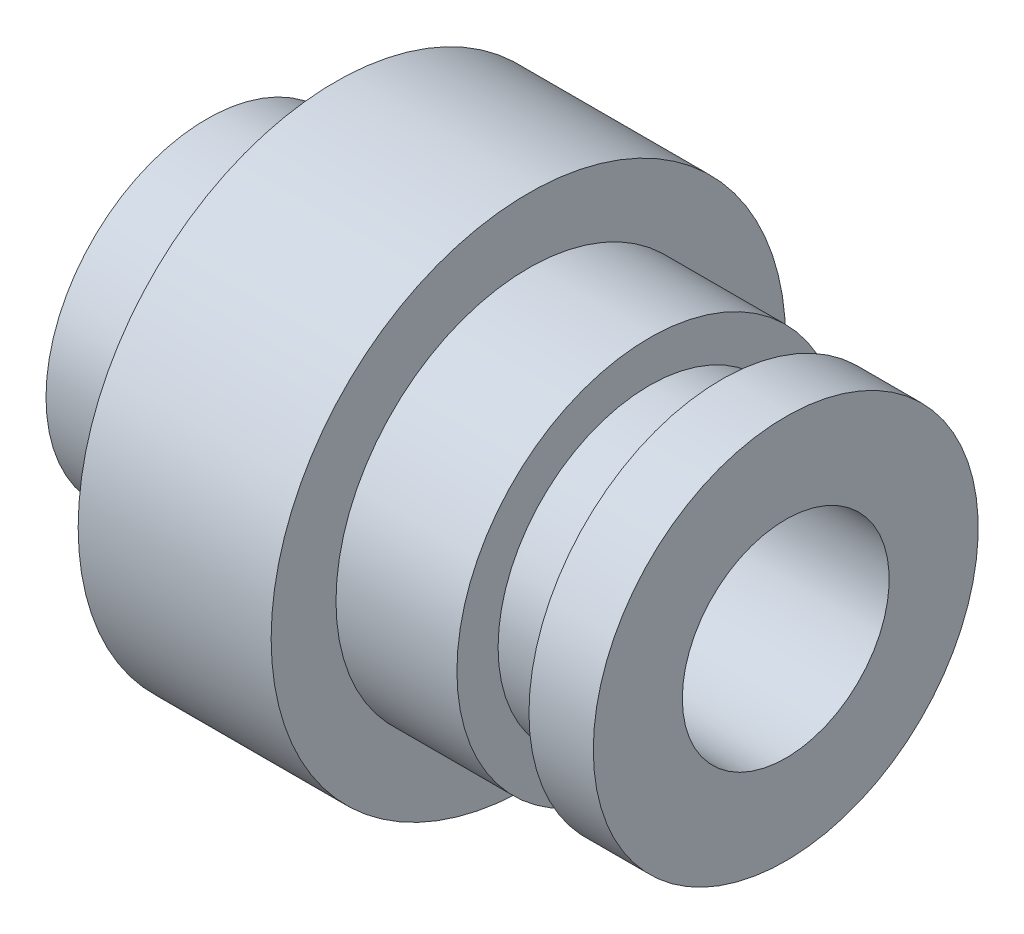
ISO-10303-21;
HEADER;
FILE_DESCRIPTION(('STEP AP214'),'2;1');
FILE_NAME('part.step','',(''),(''),'','','');
FILE_SCHEMA(('AUTOMOTIVE_DESIGN { 1 0 10303 214 1 1 1 1 }'));
ENDSEC;
DATA;
#1=APPLICATION_CONTEXT('core data for automotive mechanical design processes');
#2=APPLICATION_PROTOCOL_DEFINITION('international standard','automotive_design',2000,#1);
#3=PRODUCT_CONTEXT('',#1,'mechanical');
#4=PRODUCT('Part','Part','',(#3));
#5=PRODUCT_RELATED_PRODUCT_CATEGORY('part','',(#4));
#6=PRODUCT_DEFINITION_FORMATION('','',#4);
#7=PRODUCT_DEFINITION_CONTEXT('part definition',#1,'design');
#8=PRODUCT_DEFINITION('design','',#6,#7);
#9=PRODUCT_DEFINITION_SHAPE('','',#8);
#10=(LENGTH_UNIT() NAMED_UNIT(*) SI_UNIT(.MILLI.,.METRE.));
#11=(NAMED_UNIT(*) PLANE_ANGLE_UNIT() SI_UNIT($,.RADIAN.));
#12=(NAMED_UNIT(*) SI_UNIT($,.STERADIAN.) SOLID_ANGLE_UNIT());
#13=UNCERTAINTY_MEASURE_WITH_UNIT(LENGTH_MEASURE(1.E-05),#10,'distance_accuracy_value','');
#14=(GEOMETRIC_REPRESENTATION_CONTEXT(3) GLOBAL_UNCERTAINTY_ASSIGNED_CONTEXT((#13)) GLOBAL_UNIT_ASSIGNED_CONTEXT((#10,
#11,#12)) REPRESENTATION_CONTEXT('',''));
#15=CARTESIAN_POINT('',(0.,0.,0.));
#16=DIRECTION('',(0.,0.,1.));
#17=DIRECTION('',(1.,0.,0.));
#18=AXIS2_PLACEMENT_3D('',#15,#16,#17);
#19=CARTESIAN_POINT('',(0.,6.35,0.));
#20=DIRECTION('',(1.,0.,0.));
#21=DIRECTION('',(0.,0.,-1.));
#22=AXIS2_PLACEMENT_3D('',#19,#20,#21);
#23=PLANE('',#22);
#24=CARTESIAN_POINT('',(0.,0.,0.));
#25=DIRECTION('',(-1.,0.,0.));
#26=DIRECTION('',(0.,0.,1.));
#27=AXIS2_PLACEMENT_3D('',#24,#25,#26);
#28=CIRCLE('',#27,5.1054);
#29=CARTESIAN_POINT('',(0.,0.,5.1054));
#30=VERTEX_POINT('',#29);
#31=EDGE_CURVE('E40',#30,#30,#28,.T.);
#32=ORIENTED_EDGE('',*,*,#31,.F.);
#33=EDGE_LOOP('',(#32));
#34=FACE_BOUND('',#33,.T.);
#35=CARTESIAN_POINT('',(0.,0.,0.));
#36=DIRECTION('',(-1.,0.,0.));
#37=DIRECTION('',(0.,0.,1.));
#38=AXIS2_PLACEMENT_3D('',#35,#36,#37);
#39=CIRCLE('',#38,6.35);
#40=CARTESIAN_POINT('',(0.,0.,6.35));
#41=VERTEX_POINT('',#40);
#42=EDGE_CURVE('E79',#41,#41,#39,.T.);
#43=ORIENTED_EDGE('',*,*,#42,.T.);
#44=EDGE_LOOP('',(#43));
#45=FACE_BOUND('',#44,.T.);
#46=ADVANCED_FACE('F29',(#34,#45),#23,.F.);
#47=CARTESIAN_POINT('',(0.,0.,0.));
#48=DIRECTION('',(-1.,0.,0.));
#49=DIRECTION('',(0.,0.,1.));
#50=AXIS2_PLACEMENT_3D('',#47,#48,#49);
#51=CYLINDRICAL_SURFACE('',#50,5.1054);
#52=CARTESIAN_POINT('',(15.875,0.,0.));
#53=DIRECTION('',(-1.,0.,0.));
#54=DIRECTION('',(0.,0.,1.));
#55=AXIS2_PLACEMENT_3D('',#52,#53,#54);
#56=CIRCLE('',#55,5.1054);
#57=CARTESIAN_POINT('',(15.875,0.,5.1054));
#58=VERTEX_POINT('',#57);
#59=EDGE_CURVE('E44',#58,#58,#56,.T.);
#60=ORIENTED_EDGE('',*,*,#59,.F.);
#61=EDGE_LOOP('',(#60));
#62=FACE_BOUND('',#61,.T.);
#63=ORIENTED_EDGE('',*,*,#31,.T.);
#64=EDGE_LOOP('',(#63));
#65=FACE_BOUND('',#64,.T.);
#66=ADVANCED_FACE('F106',(#62,#65),#51,.F.);
#67=CARTESIAN_POINT('',(15.875,5.1054,0.));
#68=DIRECTION('',(-1.,0.,0.));
#69=DIRECTION('',(0.,0.,1.));
#70=AXIS2_PLACEMENT_3D('',#67,#68,#69);
#71=PLANE('',#70);
#72=CARTESIAN_POINT('',(15.875,0.,0.));
#73=DIRECTION('',(-1.,0.,0.));
#74=DIRECTION('',(0.,0.,1.));
#75=AXIS2_PLACEMENT_3D('',#72,#73,#74);
#76=CIRCLE('',#75,9.4996);
#77=CARTESIAN_POINT('',(15.875,0.,9.4996));
#78=VERTEX_POINT('',#77);
#79=EDGE_CURVE('E49',#78,#78,#76,.T.);
#80=ORIENTED_EDGE('',*,*,#79,.F.);
#81=EDGE_LOOP('',(#80));
#82=FACE_BOUND('',#81,.T.);
#83=ORIENTED_EDGE('',*,*,#59,.T.);
#84=EDGE_LOOP('',(#83));
#85=FACE_BOUND('',#84,.T.);
#86=ADVANCED_FACE('F111',(#82,#85),#71,.F.);
#87=CARTESIAN_POINT('',(0.,0.,0.));
#88=DIRECTION('',(-1.,0.,0.));
#89=DIRECTION('',(0.,0.,1.));
#90=AXIS2_PLACEMENT_3D('',#87,#88,#89);
#91=CYLINDRICAL_SURFACE('',#90,9.4996);
#92=CARTESIAN_POINT('',(12.7,0.,0.));
#93=DIRECTION('',(-1.,0.,0.));
#94=DIRECTION('',(0.,0.,1.));
#95=AXIS2_PLACEMENT_3D('',#92,#93,#94);
#96=CIRCLE('',#95,9.4996);
#97=CARTESIAN_POINT('',(12.7,0.,9.4996));
#98=VERTEX_POINT('',#97);
#99=EDGE_CURVE('E52',#98,#98,#96,.T.);
#100=ORIENTED_EDGE('',*,*,#99,.F.);
#101=EDGE_LOOP('',(#100));
#102=FACE_BOUND('',#101,.T.);
#103=ORIENTED_EDGE('',*,*,#79,.T.);
#104=EDGE_LOOP('',(#103));
#105=FACE_BOUND('',#104,.T.);
#106=ADVANCED_FACE('F118',(#102,#105),#91,.T.);
#107=CARTESIAN_POINT('',(12.7,9.4996,0.));
#108=DIRECTION('',(1.,0.,0.));
#109=DIRECTION('',(0.,0.,-1.));
#110=AXIS2_PLACEMENT_3D('',#107,#108,#109);
#111=PLANE('',#110);
#112=CARTESIAN_POINT('',(12.7,0.,0.));
#113=DIRECTION('',(-1.,0.,0.));
#114=DIRECTION('',(0.,0.,1.));
#115=AXIS2_PLACEMENT_3D('',#112,#113,#114);
#116=CIRCLE('',#115,7.4676);
#117=CARTESIAN_POINT('',(12.7,0.,7.4676));
#118=VERTEX_POINT('',#117);
#119=EDGE_CURVE('E55',#118,#118,#116,.T.);
#120=ORIENTED_EDGE('',*,*,#119,.F.);
#121=EDGE_LOOP('',(#120));
#122=FACE_BOUND('',#121,.T.);
#123=ORIENTED_EDGE('',*,*,#99,.T.);
#124=EDGE_LOOP('',(#123));
#125=FACE_BOUND('',#124,.T.);
#126=ADVANCED_FACE('F122',(#122,#125),#111,.F.);
#127=CARTESIAN_POINT('',(0.,0.,0.));
#128=DIRECTION('',(-1.,0.,0.));
#129=DIRECTION('',(0.,0.,1.));
#130=AXIS2_PLACEMENT_3D('',#127,#128,#129);
#131=CYLINDRICAL_SURFACE('',#130,7.4676);
#132=CARTESIAN_POINT('',(9.144,0.,0.));
#133=DIRECTION('',(-1.,0.,0.));
#134=DIRECTION('',(0.,0.,1.));
#135=AXIS2_PLACEMENT_3D('',#132,#133,#134);
#136=CIRCLE('',#135,7.4676);
#137=CARTESIAN_POINT('',(9.144,0.,7.4676));
#138=VERTEX_POINT('',#137);
#139=EDGE_CURVE('E58',#138,#138,#136,.T.);
#140=ORIENTED_EDGE('',*,*,#139,.F.);
#141=EDGE_LOOP('',(#140));
#142=FACE_BOUND('',#141,.T.);
#143=ORIENTED_EDGE('',*,*,#119,.T.);
#144=EDGE_LOOP('',(#143));
#145=FACE_BOUND('',#144,.T.);
#146=ADVANCED_FACE('F126',(#142,#145),#131,.T.);
#147=CARTESIAN_POINT('',(9.144,7.4676,0.));
#148=DIRECTION('',(-1.,0.,0.));
#149=DIRECTION('',(0.,0.,1.));
#150=AXIS2_PLACEMENT_3D('',#147,#148,#149);
#151=PLANE('',#150);
#152=CARTESIAN_POINT('',(9.144,0.,0.));
#153=DIRECTION('',(-1.,0.,0.));
#154=DIRECTION('',(0.,0.,1.));
#155=AXIS2_PLACEMENT_3D('',#152,#153,#154);
#156=CIRCLE('',#155,9.4996);
#157=CARTESIAN_POINT('',(9.144,0.,9.4996));
#158=VERTEX_POINT('',#157);
#159=EDGE_CURVE('E61',#158,#158,#156,.T.);
#160=ORIENTED_EDGE('',*,*,#159,.F.);
#161=EDGE_LOOP('',(#160));
#162=FACE_BOUND('',#161,.T.);
#163=ORIENTED_EDGE('',*,*,#139,.T.);
#164=EDGE_LOOP('',(#163));
#165=FACE_BOUND('',#164,.T.);
#166=ADVANCED_FACE('F130',(#162,#165),#151,.F.);
#167=CARTESIAN_POINT('',(0.,0.,0.));
#168=DIRECTION('',(-1.,0.,0.));
#169=DIRECTION('',(0.,0.,1.));
#170=AXIS2_PLACEMENT_3D('',#167,#168,#169);
#171=CYLINDRICAL_SURFACE('',#170,9.4996);
#172=CARTESIAN_POINT('',(3.175,0.,0.));
#173=DIRECTION('',(-1.,0.,0.));
#174=DIRECTION('',(0.,0.,1.));
#175=AXIS2_PLACEMENT_3D('',#172,#173,#174);
#176=CIRCLE('',#175,9.4996);
#177=CARTESIAN_POINT('',(3.175,0.,9.4996));
#178=VERTEX_POINT('',#177);
#179=EDGE_CURVE('E64',#178,#178,#176,.T.);
#180=ORIENTED_EDGE('',*,*,#179,.F.);
#181=EDGE_LOOP('',(#180));
#182=FACE_BOUND('',#181,.T.);
#183=ORIENTED_EDGE('',*,*,#159,.T.);
#184=EDGE_LOOP('',(#183));
#185=FACE_BOUND('',#184,.T.);
#186=ADVANCED_FACE('F134',(#182,#185),#171,.T.);
#187=CARTESIAN_POINT('',(3.175,9.4996,0.));
#188=DIRECTION('',(-1.,0.,0.));
#189=DIRECTION('',(0.,0.,1.));
#190=AXIS2_PLACEMENT_3D('',#187,#188,#189);
#191=PLANE('',#190);
#192=CARTESIAN_POINT('',(3.175,0.,0.));
#193=DIRECTION('',(-1.,0.,0.));
#194=DIRECTION('',(0.,0.,1.));
#195=AXIS2_PLACEMENT_3D('',#192,#193,#194);
#196=CIRCLE('',#195,12.7);
#197=CARTESIAN_POINT('',(3.175,0.,12.7));
#198=VERTEX_POINT('',#197);
#199=EDGE_CURVE('E67',#198,#198,#196,.T.);
#200=ORIENTED_EDGE('',*,*,#199,.F.);
#201=EDGE_LOOP('',(#200));
#202=FACE_BOUND('',#201,.T.);
#203=ORIENTED_EDGE('',*,*,#179,.T.);
#204=EDGE_LOOP('',(#203));
#205=FACE_BOUND('',#204,.T.);
#206=ADVANCED_FACE('F138',(#202,#205),#191,.F.);
#207=CARTESIAN_POINT('',(0.,0.,0.));
#208=DIRECTION('',(-1.,0.,0.));
#209=DIRECTION('',(0.,0.,1.));
#210=AXIS2_PLACEMENT_3D('',#207,#208,#209);
#211=CYLINDRICAL_SURFACE('',#210,12.7);
#212=CARTESIAN_POINT('',(-6.35,0.,0.));
#213=DIRECTION('',(-1.,0.,0.));
#214=DIRECTION('',(0.,0.,1.));
#215=AXIS2_PLACEMENT_3D('',#212,#213,#214);
#216=CIRCLE('',#215,12.7);
#217=CARTESIAN_POINT('',(-6.35,0.,12.7));
#218=VERTEX_POINT('',#217);
#219=EDGE_CURVE('E70',#218,#218,#216,.T.);
#220=ORIENTED_EDGE('',*,*,#219,.F.);
#221=EDGE_LOOP('',(#220));
#222=FACE_BOUND('',#221,.T.);
#223=ORIENTED_EDGE('',*,*,#199,.T.);
#224=EDGE_LOOP('',(#223));
#225=FACE_BOUND('',#224,.T.);
#226=ADVANCED_FACE('F103',(#222,#225),#211,.T.);
#227=CARTESIAN_POINT('',(-6.35,7.9375,0.));
#228=DIRECTION('',(1.,0.,0.));
#229=DIRECTION('',(0.,0.,-1.));
#230=AXIS2_PLACEMENT_3D('',#227,#228,#229);
#231=PLANE('',#230);
#232=CARTESIAN_POINT('',(-6.35,0.,0.));
#233=DIRECTION('',(1.,0.,0.));
#234=DIRECTION('',(0.,0.,-1.));
#235=AXIS2_PLACEMENT_3D('',#232,#233,#234);
#236=CIRCLE('',#235,11.1125);
#237=CARTESIAN_POINT('',(-6.35,0.,-11.1125));
#238=VERTEX_POINT('',#237);
#239=EDGE_CURVE('E10',#238,#238,#236,.T.);
#240=ORIENTED_EDGE('',*,*,#239,.T.);
#241=EDGE_LOOP('',(#240));
#242=FACE_BOUND('',#241,.T.);
#243=ORIENTED_EDGE('',*,*,#219,.T.);
#244=EDGE_LOOP('',(#243));
#245=FACE_BOUND('',#244,.T.);
#246=ADVANCED_FACE('F98',(#242,#245),#231,.F.);
#247=CARTESIAN_POINT('',(0.,0.,0.));
#248=DIRECTION('',(-1.,0.,0.));
#249=DIRECTION('',(0.,0.,1.));
#250=AXIS2_PLACEMENT_3D('',#247,#248,#249);
#251=CYLINDRICAL_SURFACE('',#250,7.9375);
#252=CARTESIAN_POINT('',(-9.525,0.,0.));
#253=DIRECTION('',(1.,0.,0.));
#254=DIRECTION('',(0.,0.,-1.));
#255=AXIS2_PLACEMENT_3D('',#252,#253,#254);
#256=CIRCLE('',#255,7.9375);
#257=CARTESIAN_POINT('',(-9.525,0.,-7.9375));
#258=VERTEX_POINT('',#257);
#259=EDGE_CURVE('E36',#258,#258,#256,.F.);
#260=ORIENTED_EDGE('',*,*,#259,.T.);
#261=EDGE_LOOP('',(#260));
#262=FACE_BOUND('',#261,.T.);
#263=CARTESIAN_POINT('',(-12.7,0.,0.));
#264=DIRECTION('',(-1.,0.,0.));
#265=DIRECTION('',(0.,0.,1.));
#266=AXIS2_PLACEMENT_3D('',#263,#264,#265);
#267=CIRCLE('',#266,7.9375);
#268=CARTESIAN_POINT('',(-12.7,0.,7.9375));
#269=VERTEX_POINT('',#268);
#270=EDGE_CURVE('E73',#269,#269,#267,.T.);
#271=ORIENTED_EDGE('',*,*,#270,.F.);
#272=EDGE_LOOP('',(#271));
#273=FACE_BOUND('',#272,.T.);
#274=ADVANCED_FACE('F93',(#262,#273),#251,.T.);
#275=CARTESIAN_POINT('',(-12.7,7.9375,0.));
#276=DIRECTION('',(1.,0.,0.));
#277=DIRECTION('',(0.,0.,-1.));
#278=AXIS2_PLACEMENT_3D('',#275,#276,#277);
#279=PLANE('',#278);
#280=CARTESIAN_POINT('',(-12.7,0.,0.));
#281=DIRECTION('',(-1.,0.,0.));
#282=DIRECTION('',(0.,0.,1.));
#283=AXIS2_PLACEMENT_3D('',#280,#281,#282);
#284=CIRCLE('',#283,6.35);
#285=CARTESIAN_POINT('',(-12.7,0.,6.35));
#286=VERTEX_POINT('',#285);
#287=EDGE_CURVE('E76',#286,#286,#284,.T.);
#288=ORIENTED_EDGE('',*,*,#287,.F.);
#289=EDGE_LOOP('',(#288));
#290=FACE_BOUND('',#289,.T.);
#291=ORIENTED_EDGE('',*,*,#270,.T.);
#292=EDGE_LOOP('',(#291));
#293=FACE_BOUND('',#292,.T.);
#294=ADVANCED_FACE('F87',(#290,#293),#279,.F.);
#295=CARTESIAN_POINT('',(0.,0.,0.));
#296=DIRECTION('',(-1.,0.,0.));
#297=DIRECTION('',(0.,0.,1.));
#298=AXIS2_PLACEMENT_3D('',#295,#296,#297);
#299=CYLINDRICAL_SURFACE('',#298,6.35);
#300=ORIENTED_EDGE('',*,*,#42,.F.);
#301=EDGE_LOOP('',(#300));
#302=FACE_BOUND('',#301,.T.);
#303=ORIENTED_EDGE('',*,*,#287,.T.);
#304=EDGE_LOOP('',(#303));
#305=FACE_BOUND('',#304,.T.);
#306=ADVANCED_FACE('F84',(#302,#305),#299,.F.);
#307=CARTESIAN_POINT('',(-9.525,0.,0.));
#308=DIRECTION('',(1.,0.,0.));
#309=DIRECTION('',(0.,0.,-1.));
#310=AXIS2_PLACEMENT_3D('',#307,#308,#309);
#311=TOROIDAL_SURFACE('',#310,11.1125,3.175);
#312=ORIENTED_EDGE('',*,*,#239,.F.);
#313=EDGE_LOOP('',(#312));
#314=FACE_BOUND('',#313,.T.);
#315=ORIENTED_EDGE('',*,*,#259,.F.);
#316=EDGE_LOOP('',(#315));
#317=FACE_BOUND('',#316,.T.);
#318=ADVANCED_FACE('F31',(#314,#317),#311,.F.);
#319=CLOSED_SHELL('',(#46,#66,#86,#106,#126,#146,#166,#186,#206,#226,#246,#274,#294,#306,#318));
#320=MANIFOLD_SOLID_BREP('B2',#319);
#321=ADVANCED_BREP_SHAPE_REPRESENTATION('',(#18,#320),#14);
#322=SHAPE_DEFINITION_REPRESENTATION(#9,#321);
ENDSEC;
END-ISO-10303-21;
